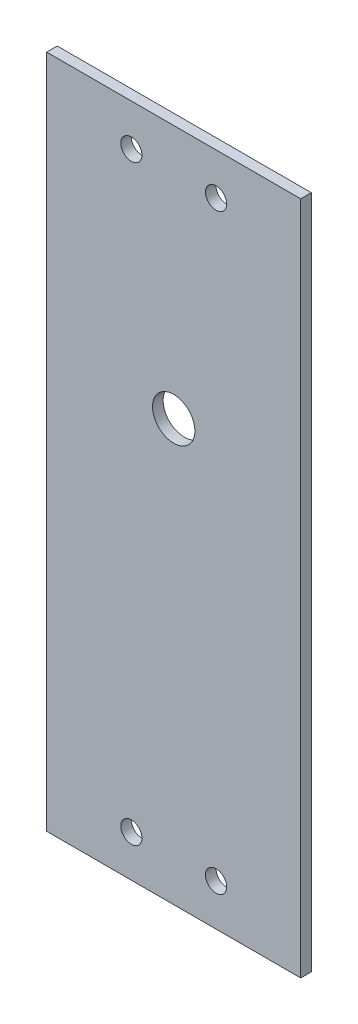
from build123d import *

# Parameters (mm, degrees)
SKETCH1_W           = 76.2
SKETCH1_H           = 202.4
BOSS_EXTRUDE1_DEPTH = 3.175
SKETCH2_R           = 3.175
SKETCH2_R_2         = 6.35
CUT_EXTRUDE1_DEPTH  = 3.175


with BuildPart() as part:
    # Sketch1 → Boss-Extrude1 (new body)
    with BuildSketch(Plane.XY):
        with Locations((38.1, -101.2)):
            Rectangle(SKETCH1_W, SKETCH1_H)
    extrude(amount=BOSS_EXTRUDE1_DEPTH)

    # Sketch2 → Cut-Extrude1 (cut)
    with BuildSketch(Plane.XY.offset(3.175)):
        with Locations((25.4, -12.5)):
            Circle(SKETCH2_R)
        with Locations((50.8, -12.5)):
            Circle(SKETCH2_R)
        with Locations((50.8, -189.9)):
            Circle(SKETCH2_R)
        with Locations((25.4, -189.9)):
            Circle(SKETCH2_R)
        with Locations((38.1, -76.2)):
            Circle(SKETCH2_R_2)
    extrude(amount=-CUT_EXTRUDE1_DEPTH, mode=Mode.SUBTRACT)


solid = part.part
